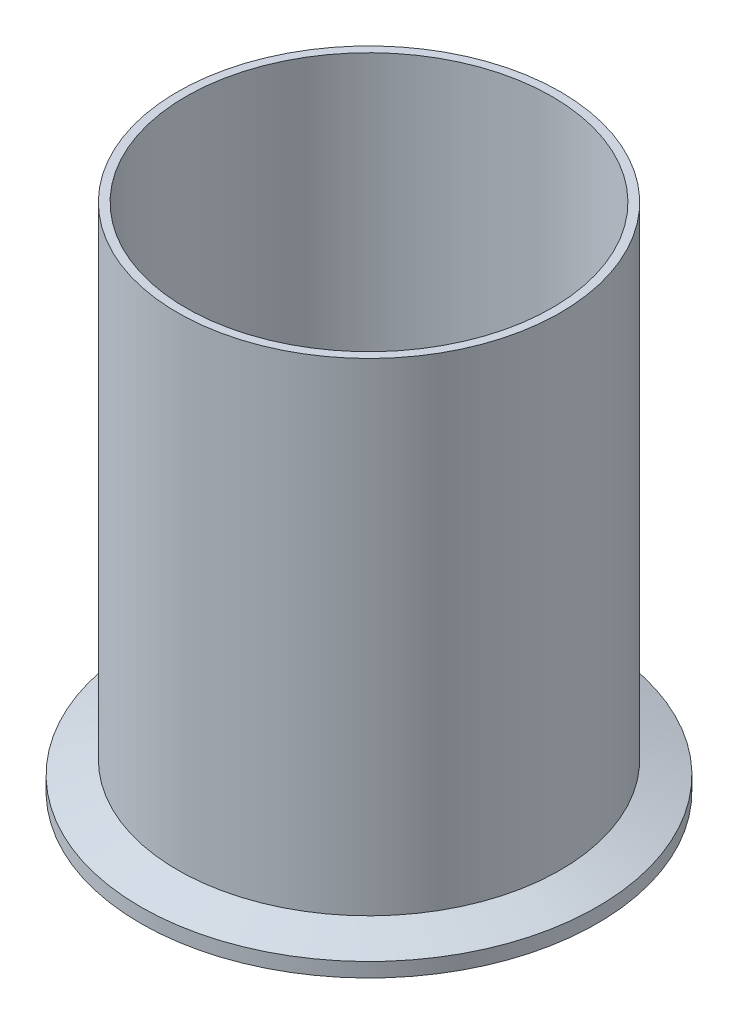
from build123d import *


with BuildPart() as part:
    # Sketch1 → Revolve2 (revolve)
    with BuildSketch(Plane.XY, mode=Mode.PRIVATE) as revolve2_sk:
        with BuildLine():
            Line((-36.449, 0), (-36.449, 101.6))
            Line((-36.449, 101.6), (-38.1, 101.6))
            Line((-38.1, 101.6), (-38.1, 5.521182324))
            Line((-38.1, 5.521182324), (-45.4533, 2.8448))
            Line((-45.4533, 2.8448), (-45.4533, 0))
            Line((-45.4533, 0), (-43.486708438, 0))
            ThreePointArc((-43.486708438, 0), (-43.054511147, 0.129217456), (-42.764166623, 0.474458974))
            ThreePointArc((-42.764166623, 0.474458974), (-41.6687, 1.1938), (-40.573233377, 0.474458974))
            ThreePointArc((-40.573233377, 0.474458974), (-40.282888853, 0.129217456), (-39.850691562, 0))
            Line((-39.850691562, 0), (-36.449, 0))
        make_face()
    revolve(revolve2_sk.sketch.rotate(Axis((0, 0, 0), (0, 1, 0)), 270), axis=Axis((0, 0, 0), (0, 1, 0)))


solid = part.part
